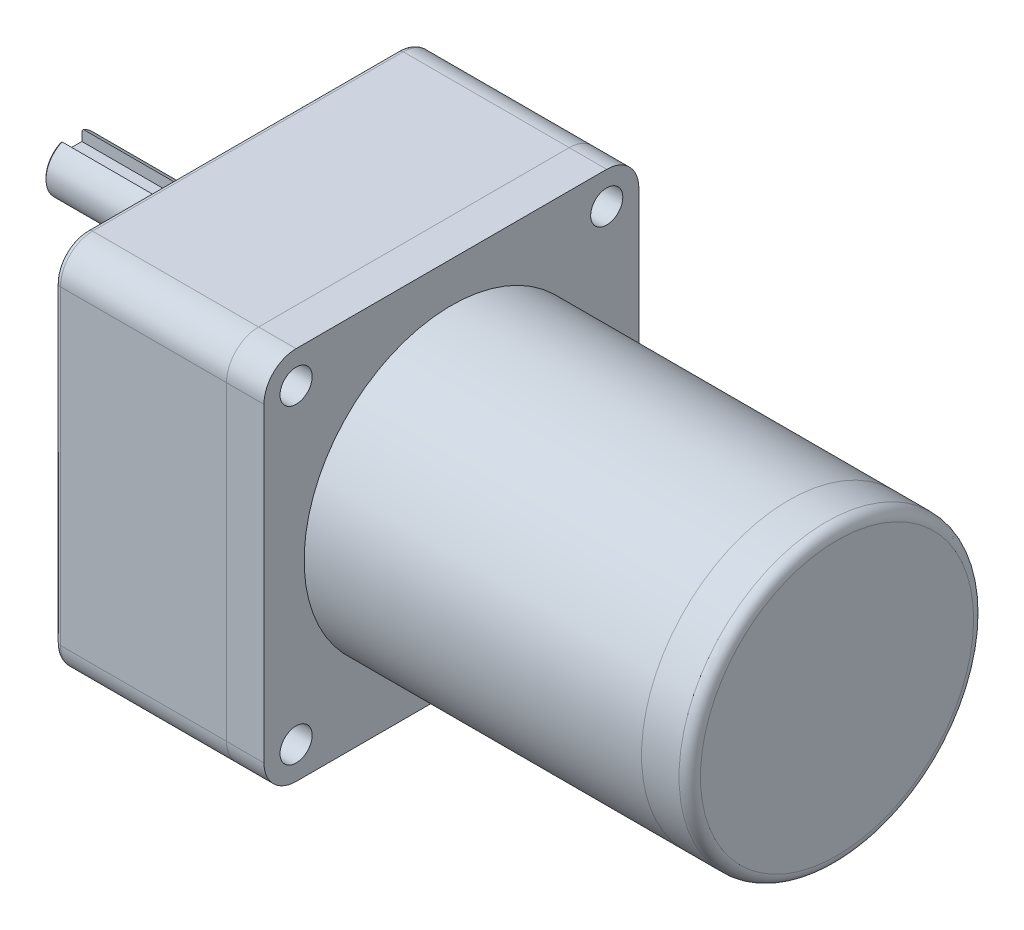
from build123d import *

# Parameters (mm, degrees)
EXTRUDE_1_DEPTH             = 32
EXTRUDE_2_DEPTH             = 7
FILLET_1_R                  = 1
SKETCH_3_R                  = 27.5
EXTRUDE_3_DEPTH             = 63
SKETCH_4_R                  = 27.5
EXTRUDE_4_DEPTH             = 9
FILLET_2_R                  = 2
HOLE_WIZARD_M5_1_AT_2_COUNT = 2
HOLE_WIZARD_M5_1_AT_2_PITCH = 57.982756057
HOLE_WIZARD_M5_1_AT_3_COUNT = 2
HOLE_WIZARD_M5_1_AT_3_PITCH = 82
HOLE_WIZARD_M5_1_AT_4_COUNT = 2
HOLE_WIZARD_M5_1_AT_4_PITCH = 57.982756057
SKETCH_7_R                  = 3
CUT_EXTRUDE_1_DEPTH         = 25
SKETCH_8_R                  = 12
EXTRUDE_5_DEPTH             = 3
SKETCH_9_R                  = 5
EXTRUDE_6_DEPTH             = 29
FILLET_3_R                  = 0.5
SKETCH_10_R                 = 30
CUT_EXTRUDE_2_DEPTH         = 0.5
CUT_EXTRUDE_3_DEPTH         = 2.5
CHAMFER_1_SIZE              = 0.3


with BuildPart() as part:
    # Sketch 1 → Extrude 1 (new body)
    with BuildSketch(Plane(origin=(0, 0, 0), x_dir=(0, 0, -1), z_dir=(1, 0, 0))):
        with BuildLine():
            Line((29, -35), (-29, -35))
            ThreePointArc((-29, -35), (-33.242640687, -33.242640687), (-35, -29))
            Line((-35, -29), (-35, 29))
            ThreePointArc((-35, 29), (-33.242640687, 33.242640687), (-29, 35))
            Line((-29, 35), (29, 35))
            ThreePointArc((29, 35), (33.242640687, 33.242640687), (35, 29))
            Line((35, 29), (35, -29))
            ThreePointArc((35, -29), (33.242640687, -33.242640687), (29, -35))
        make_face()
    extrude(amount=EXTRUDE_1_DEPTH)

    # Fillet 1
    fillet_1_edges = [part.edges().sort_by_distance(p)[0] for p in [
        (0, -35, 0),
        (0, -33.242640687, 33.242640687),
        (0, 0, 35),
        (0, 33.242640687, 33.242640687),
        (0, 35, 0),
        (0, 33.242640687, -33.242640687),
        (0, 0, -35),
        (0, -33.242640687, -33.242640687),
    ]]
    fillet(fillet_1_edges, radius=FILLET_1_R)

    # Sketch 6 → Hole Wizard M5 _1 (revolve, cut)
    with BuildSketch(Plane(origin=(0, 28.991378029, -28.991378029), x_dir=(0, 0, 1), z_dir=(0, 1, 0))):
        Polygon((0, 0), (0, 15.2618073), (2.1, 14), (2.1, 0), align=None)
    hole_wizard_m5_1 = revolve(axis=Axis((-6.35, 28.991378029, -28.991378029), (1, 0, 0)), mode=Mode.SUBTRACT)

    # Hole Wizard M5 _1 at 2: Hole Wizard M5 _1 ×2
    with Locations(*[(0, -i * HOLE_WIZARD_M5_1_AT_2_PITCH, 0) for i in range(1, HOLE_WIZARD_M5_1_AT_2_COUNT)]):
        add(hole_wizard_m5_1, mode=Mode.SUBTRACT)

    # Hole Wizard M5 _1 at 3: Hole Wizard M5 _1 ×2
    with Locations(*[Vector(0, -0.7071067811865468, 0.7071067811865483) * (i * HOLE_WIZARD_M5_1_AT_3_PITCH) for i in range(1, HOLE_WIZARD_M5_1_AT_3_COUNT)]):
        add(hole_wizard_m5_1, mode=Mode.SUBTRACT)

    # Hole Wizard M5 _1 at 4: Hole Wizard M5 _1 ×2
    with Locations(*[(0, 0, i * HOLE_WIZARD_M5_1_AT_4_PITCH) for i in range(1, HOLE_WIZARD_M5_1_AT_4_COUNT)]):
        add(hole_wizard_m5_1, mode=Mode.SUBTRACT)


with BuildPart() as body_2:
    # Sketch 2 → Extrude 2 (new body)
    with BuildSketch(Plane(origin=(32, 0, 0), x_dir=(0, 0, -1), z_dir=(1, 0, 0))):
        with BuildLine():
            Line((-29, -35), (29, -35))
            ThreePointArc((29, -35), (33.242640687, -33.242640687), (35, -29))
            Line((35, -29), (35, 29))
            ThreePointArc((35, 29), (33.242640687, 33.242640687), (29, 35))
            Line((29, 35), (-29, 35))
            ThreePointArc((-29, 35), (-33.242640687, 33.242640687), (-35, 29))
            Line((-35, 29), (-35, -29))
            ThreePointArc((-35, -29), (-33.242640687, -33.242640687), (-29, -35))
        make_face()
    extrude(amount=EXTRUDE_2_DEPTH)


with BuildPart() as body_3:
    # Sketch 3 → Extrude 3 (new body)
    with BuildSketch(Plane(origin=(39, 0, 0), x_dir=(0, 0, -1), z_dir=(1, 0, 0))):
        Circle(SKETCH_3_R)
    extrude(amount=EXTRUDE_3_DEPTH)


with BuildPart() as body_4:
    # Sketch 4 → Extrude 4 (new body)
    with BuildSketch(Plane(origin=(102, 0, 0), x_dir=(0, 0, -1), z_dir=(1, 0, 0))):
        Circle(SKETCH_4_R)
    extrude(amount=EXTRUDE_4_DEPTH)

    # Fillet 2
    fillet_2_edges = [body_4.edges().sort_by_distance(p)[0] for p in [
        (111, 0, 27.5),
    ]]
    fillet(fillet_2_edges, radius=FILLET_2_R)


with BuildPart() as cut_extrude_1_tool:
    # Sketch 7 → Cut-Extrude 1 (new body)
    with BuildSketch(Plane(origin=(39, 0, 0), x_dir=(0, 0, -1), z_dir=(1, 0, 0))):
        with Locations((-29, 29)):
            Circle(SKETCH_7_R)
        with Locations((29, 29)):
            Circle(SKETCH_7_R)
        with Locations((29, -29)):
            Circle(SKETCH_7_R)
        with Locations((-29, -29)):
            Circle(SKETCH_7_R)
    extrude(amount=-CUT_EXTRUDE_1_DEPTH)


with BuildPart() as part_1:
    add(part.part)

    # Cut-Extrude 1: cut by cut_extrude_1_tool
    add(cut_extrude_1_tool.part, mode=Mode.SUBTRACT)

    # Sketch 10 → Cut-Extrude 2 (cut)
    with BuildSketch(Plane.ZY):
        Circle(SKETCH_10_R)
    extrude(amount=-CUT_EXTRUDE_2_DEPTH, mode=Mode.SUBTRACT)


with BuildPart() as body_2_1:
    add(body_2.part)

    # Cut-Extrude 1: cut by cut_extrude_1_tool
    add(cut_extrude_1_tool.part, mode=Mode.SUBTRACT)


with BuildPart() as body_5:
    # Sketch 8 → Extrude 5 (new body)
    with BuildSketch(Plane.ZY):
        with Locations((0, 15)):
            Circle(SKETCH_8_R)
    extrude(amount=EXTRUDE_5_DEPTH)

    # Fillet 3
    fillet_3_edges = [body_5.edges().sort_by_distance(p)[0] for p in [
        (-3, 15, -12),
    ]]
    fillet(fillet_3_edges, radius=FILLET_3_R)


with BuildPart() as body_6:
    # Sketch 9 → Extrude 6 (new body)
    with BuildSketch(Plane.ZY.offset(3)):
        with Locations(Location((0, 15, 0), (0, 0, 180))):
            Circle(SKETCH_9_R)
    extrude(amount=EXTRUDE_6_DEPTH)

    # Sketch 11 → Cut-Extrude 3 (cut)
    with BuildSketch(Plane(origin=(0, 20, 0), x_dir=(1, 0, 0), z_dir=(0, 1, 0))):
        with BuildLine():
            Line((-9, 2), (-32, 2))
            Line((-32, 2), (-32, -2))
            Line((-32, -2), (-9, -2))
            ThreePointArc((-9, -2), (-7, 0), (-9, 2))
        make_face()
    extrude(amount=-CUT_EXTRUDE_3_DEPTH, mode=Mode.SUBTRACT)

    # Chamfer 1
    chamfer_1_edges = [body_6.edges().sort_by_distance(p)[0] for p in [
        (-32, 10.816699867, 2.738612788),
    ]]
    chamfer(chamfer_1_edges, length=CHAMFER_1_SIZE)


solid = Compound([body_3.part, body_4.part, part_1.part, body_2_1.part, body_5.part, body_6.part])
